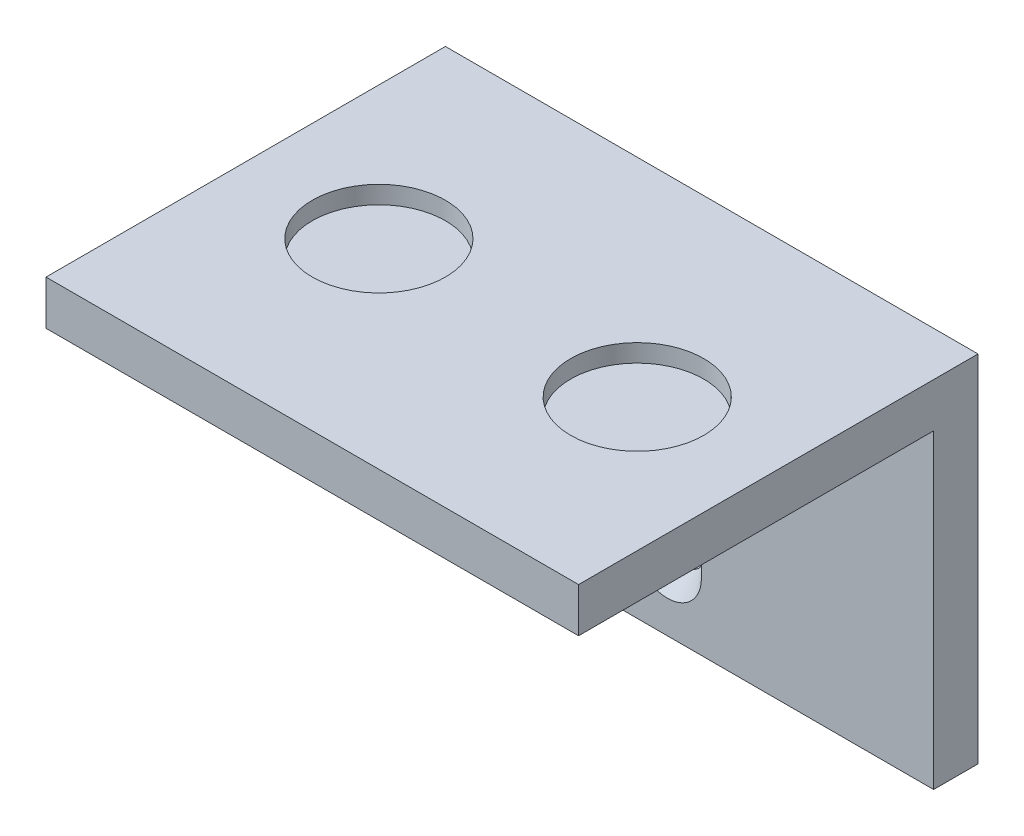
ISO-10303-21;
HEADER;
FILE_DESCRIPTION(('STEP AP214'),'2;1');
FILE_NAME('part.step','',(''),(''),'','','');
FILE_SCHEMA(('AUTOMOTIVE_DESIGN { 1 0 10303 214 1 1 1 1 }'));
ENDSEC;
DATA;
#1=APPLICATION_CONTEXT('core data for automotive mechanical design processes');
#2=APPLICATION_PROTOCOL_DEFINITION('international standard','automotive_design',2000,#1);
#3=PRODUCT_CONTEXT('',#1,'mechanical');
#4=PRODUCT('Part','Part','',(#3));
#5=PRODUCT_RELATED_PRODUCT_CATEGORY('part','',(#4));
#6=PRODUCT_DEFINITION_FORMATION('','',#4);
#7=PRODUCT_DEFINITION_CONTEXT('part definition',#1,'design');
#8=PRODUCT_DEFINITION('design','',#6,#7);
#9=PRODUCT_DEFINITION_SHAPE('','',#8);
#10=(LENGTH_UNIT() NAMED_UNIT(*) SI_UNIT(.MILLI.,.METRE.));
#11=(NAMED_UNIT(*) PLANE_ANGLE_UNIT() SI_UNIT($,.RADIAN.));
#12=(NAMED_UNIT(*) SI_UNIT($,.STERADIAN.) SOLID_ANGLE_UNIT());
#13=UNCERTAINTY_MEASURE_WITH_UNIT(LENGTH_MEASURE(1.E-05),#10,'distance_accuracy_value','');
#14=(GEOMETRIC_REPRESENTATION_CONTEXT(3) GLOBAL_UNCERTAINTY_ASSIGNED_CONTEXT((#13)) GLOBAL_UNIT_ASSIGNED_CONTEXT((#10,
#11,#12)) REPRESENTATION_CONTEXT('',''));
#15=CARTESIAN_POINT('',(0.,0.,0.));
#16=DIRECTION('',(0.,0.,1.));
#17=DIRECTION('',(1.,0.,0.));
#18=AXIS2_PLACEMENT_3D('',#15,#16,#17);
#19=CARTESIAN_POINT('',(0.,0.,12.7));
#20=DIRECTION('',(0.,0.,-1.));
#21=DIRECTION('',(-1.,0.,0.));
#22=AXIS2_PLACEMENT_3D('',#19,#20,#21);
#23=PLANE('',#22);
#24=DIRECTION('',(0.,-1.,0.));
#25=VECTOR('',#24,1.);
#26=CARTESIAN_POINT('',(85.9409,0.,12.7));
#27=LINE('',#26,#25);
#28=CARTESIAN_POINT('',(85.9409,59.89,12.7));
#29=VERTEX_POINT('',#28);
#30=CARTESIAN_POINT('',(85.9409,19.0500015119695,12.7));
#31=VERTEX_POINT('',#30);
#32=EDGE_CURVE('E275',#29,#31,#27,.T.);
#33=ORIENTED_EDGE('',*,*,#32,.T.);
#34=CARTESIAN_POINT('',(76.2,19.05,12.7));
#35=DIRECTION('',(0.,0.,-1.));
#36=DIRECTION('',(-1.,0.,0.));
#37=AXIS2_PLACEMENT_3D('',#34,#35,#36);
#38=CIRCLE('',#37,9.74090000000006);
#39=CARTESIAN_POINT('',(66.4591,19.0500015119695,12.7));
#40=VERTEX_POINT('',#39);
#41=EDGE_CURVE('E278',#31,#40,#38,.T.);
#42=ORIENTED_EDGE('',*,*,#41,.T.);
#43=DIRECTION('',(0.,1.,0.));
#44=VECTOR('',#43,1.);
#45=CARTESIAN_POINT('',(66.4591,59.89,12.7));
#46=LINE('',#45,#44);
#47=CARTESIAN_POINT('',(66.4591,59.89,12.7));
#48=VERTEX_POINT('',#47);
#49=EDGE_CURVE('E269',#40,#48,#46,.T.);
#50=ORIENTED_EDGE('',*,*,#49,.T.);
#51=CARTESIAN_POINT('',(76.2,59.89,12.7));
#52=DIRECTION('',(0.,0.,-1.));
#53=DIRECTION('',(-1.,0.,0.));
#54=AXIS2_PLACEMENT_3D('',#51,#52,#53);
#55=CIRCLE('',#54,9.7409);
#56=EDGE_CURVE('E272',#48,#29,#55,.T.);
#57=ORIENTED_EDGE('',*,*,#56,.T.);
#58=EDGE_LOOP('',(#33,#42,#50,#57));
#59=FACE_BOUND('',#58,.T.);
#60=DIRECTION('',(1.,0.,0.));
#61=VECTOR('',#60,1.);
#62=CARTESIAN_POINT('',(0.,88.9,12.7));
#63=LINE('',#62,#61);
#64=CARTESIAN_POINT('',(0.,88.9,12.7));
#65=VERTEX_POINT('',#64);
#66=CARTESIAN_POINT('',(152.4,88.9,12.7));
#67=VERTEX_POINT('',#66);
#68=EDGE_CURVE('E190',#65,#67,#63,.T.);
#69=ORIENTED_EDGE('',*,*,#68,.F.);
#70=DIRECTION('',(0.,-1.,0.));
#71=VECTOR('',#70,1.);
#72=CARTESIAN_POINT('',(0.,0.,12.7));
#73=LINE('',#72,#71);
#74=CARTESIAN_POINT('',(0.,0.,12.7));
#75=VERTEX_POINT('',#74);
#76=EDGE_CURVE('E229',#65,#75,#73,.T.);
#77=ORIENTED_EDGE('',*,*,#76,.T.);
#78=DIRECTION('',(1.,0.,0.));
#79=VECTOR('',#78,1.);
#80=CARTESIAN_POINT('',(0.,0.,12.7));
#81=LINE('',#80,#79);
#82=CARTESIAN_POINT('',(152.4,0.,12.7));
#83=VERTEX_POINT('',#82);
#84=EDGE_CURVE('E232',#75,#83,#81,.T.);
#85=ORIENTED_EDGE('',*,*,#84,.T.);
#86=DIRECTION('',(0.,1.,0.));
#87=VECTOR('',#86,1.);
#88=CARTESIAN_POINT('',(152.4,0.,12.7));
#89=LINE('',#88,#87);
#90=EDGE_CURVE('E236',#83,#67,#89,.T.);
#91=ORIENTED_EDGE('',*,*,#90,.T.);
#92=EDGE_LOOP('',(#69,#77,#85,#91));
#93=FACE_BOUND('',#92,.T.);
#94=ADVANCED_FACE('F49',(#59,#93),#23,.F.);
#95=CARTESIAN_POINT('',(0.,0.,12.7));
#96=DIRECTION('',(1.,0.,0.));
#97=DIRECTION('',(0.,0.,-1.));
#98=AXIS2_PLACEMENT_3D('',#95,#96,#97);
#99=PLANE('',#98);
#100=DIRECTION('',(0.,-1.,0.));
#101=VECTOR('',#100,1.);
#102=CARTESIAN_POINT('',(0.,0.,0.));
#103=LINE('',#102,#101);
#104=CARTESIAN_POINT('',(0.,101.6,0.));
#105=VERTEX_POINT('',#104);
#106=CARTESIAN_POINT('',(0.,0.,0.));
#107=VERTEX_POINT('',#106);
#108=EDGE_CURVE('E228',#105,#107,#103,.T.);
#109=ORIENTED_EDGE('',*,*,#108,.T.);
#110=DIRECTION('',(0.,0.,-1.));
#111=VECTOR('',#110,1.);
#112=CARTESIAN_POINT('',(0.,0.,12.7));
#113=LINE('',#112,#111);
#114=EDGE_CURVE('E262',#75,#107,#113,.T.);
#115=ORIENTED_EDGE('',*,*,#114,.F.);
#116=ORIENTED_EDGE('',*,*,#76,.F.);
#117=DIRECTION('',(0.,0.,-1.));
#118=VECTOR('',#117,1.);
#119=CARTESIAN_POINT('',(0.,88.9,114.3));
#120=LINE('',#119,#118);
#121=CARTESIAN_POINT('',(0.,88.9,114.3));
#122=VERTEX_POINT('',#121);
#123=EDGE_CURVE('E224',#122,#65,#120,.T.);
#124=ORIENTED_EDGE('',*,*,#123,.F.);
#125=DIRECTION('',(0.,-1.,0.));
#126=VECTOR('',#125,1.);
#127=CARTESIAN_POINT('',(0.,101.6,114.3));
#128=LINE('',#127,#126);
#129=CARTESIAN_POINT('',(0.,101.6,114.3));
#130=VERTEX_POINT('',#129);
#131=EDGE_CURVE('E202',#130,#122,#128,.T.);
#132=ORIENTED_EDGE('',*,*,#131,.F.);
#133=DIRECTION('',(0.,0.,-1.));
#134=VECTOR('',#133,1.);
#135=CARTESIAN_POINT('',(0.,101.6,12.7));
#136=LINE('',#135,#134);
#137=EDGE_CURVE('E239',#130,#105,#136,.T.);
#138=ORIENTED_EDGE('',*,*,#137,.T.);
#139=EDGE_LOOP('',(#109,#115,#116,#124,#132,#138));
#140=FACE_BOUND('',#139,.T.);
#141=ADVANCED_FACE('F318',(#140),#99,.F.);
#142=CARTESIAN_POINT('',(0.,0.,12.7));
#143=DIRECTION('',(0.,1.,0.));
#144=DIRECTION('',(0.,0.,1.));
#145=AXIS2_PLACEMENT_3D('',#142,#143,#144);
#146=PLANE('',#145);
#147=DIRECTION('',(1.,0.,0.));
#148=VECTOR('',#147,1.);
#149=CARTESIAN_POINT('',(0.,0.,0.));
#150=LINE('',#149,#148);
#151=CARTESIAN_POINT('',(152.4,0.,0.));
#152=VERTEX_POINT('',#151);
#153=EDGE_CURVE('E243',#107,#152,#150,.T.);
#154=ORIENTED_EDGE('',*,*,#153,.T.);
#155=DIRECTION('',(0.,0.,-1.));
#156=VECTOR('',#155,1.);
#157=CARTESIAN_POINT('',(152.4,0.,12.7));
#158=LINE('',#157,#156);
#159=EDGE_CURVE('E258',#83,#152,#158,.T.);
#160=ORIENTED_EDGE('',*,*,#159,.F.);
#161=ORIENTED_EDGE('',*,*,#84,.F.);
#162=ORIENTED_EDGE('',*,*,#114,.T.);
#163=EDGE_LOOP('',(#154,#160,#161,#162));
#164=FACE_BOUND('',#163,.T.);
#165=ADVANCED_FACE('F326',(#164),#146,.F.);
#166=CARTESIAN_POINT('',(152.4,0.,12.7));
#167=DIRECTION('',(-1.,0.,0.));
#168=DIRECTION('',(0.,0.,1.));
#169=AXIS2_PLACEMENT_3D('',#166,#167,#168);
#170=PLANE('',#169);
#171=DIRECTION('',(0.,1.,0.));
#172=VECTOR('',#171,1.);
#173=CARTESIAN_POINT('',(152.4,0.,0.));
#174=LINE('',#173,#172);
#175=CARTESIAN_POINT('',(152.4,101.6,0.));
#176=VERTEX_POINT('',#175);
#177=EDGE_CURVE('E246',#152,#176,#174,.T.);
#178=ORIENTED_EDGE('',*,*,#177,.T.);
#179=DIRECTION('',(0.,0.,-1.));
#180=VECTOR('',#179,1.);
#181=CARTESIAN_POINT('',(152.4,101.6,12.7));
#182=LINE('',#181,#180);
#183=CARTESIAN_POINT('',(152.4,101.6,114.3));
#184=VERTEX_POINT('',#183);
#185=EDGE_CURVE('E254',#184,#176,#182,.T.);
#186=ORIENTED_EDGE('',*,*,#185,.F.);
#187=DIRECTION('',(0.,1.,0.));
#188=VECTOR('',#187,1.);
#189=CARTESIAN_POINT('',(152.4,101.6,114.3));
#190=LINE('',#189,#188);
#191=CARTESIAN_POINT('',(152.4,88.9,114.3));
#192=VERTEX_POINT('',#191);
#193=EDGE_CURVE('E209',#192,#184,#190,.T.);
#194=ORIENTED_EDGE('',*,*,#193,.F.);
#195=DIRECTION('',(0.,0.,-1.));
#196=VECTOR('',#195,1.);
#197=CARTESIAN_POINT('',(152.4,88.9,114.3));
#198=LINE('',#197,#196);
#199=EDGE_CURVE('E217',#192,#67,#198,.T.);
#200=ORIENTED_EDGE('',*,*,#199,.T.);
#201=ORIENTED_EDGE('',*,*,#90,.F.);
#202=ORIENTED_EDGE('',*,*,#159,.T.);
#203=EDGE_LOOP('',(#178,#186,#194,#200,#201,#202));
#204=FACE_BOUND('',#203,.T.);
#205=ADVANCED_FACE('F338',(#204),#170,.F.);
#206=CARTESIAN_POINT('',(0.,101.6,12.7));
#207=DIRECTION('',(0.,-1.,0.));
#208=DIRECTION('',(0.,0.,-1.));
#209=AXIS2_PLACEMENT_3D('',#206,#207,#208);
#210=PLANE('',#209);
#211=CARTESIAN_POINT('',(38.1,101.6,57.15));
#212=DIRECTION('',(0.,1.,0.));
#213=DIRECTION('',(0.,0.,1.));
#214=AXIS2_PLACEMENT_3D('',#211,#212,#213);
#215=CIRCLE('',#214,19.05);
#216=CARTESIAN_POINT('',(38.1,101.6,76.2));
#217=VERTEX_POINT('',#216);
#218=EDGE_CURVE('E191',#217,#217,#215,.T.);
#219=ORIENTED_EDGE('',*,*,#218,.F.);
#220=EDGE_LOOP('',(#219));
#221=FACE_BOUND('',#220,.T.);
#222=CARTESIAN_POINT('',(114.3,101.6,59.4174520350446));
#223=DIRECTION('',(0.,1.,0.));
#224=DIRECTION('',(0.,0.,1.));
#225=AXIS2_PLACEMENT_3D('',#222,#223,#224);
#226=CIRCLE('',#225,19.05);
#227=CARTESIAN_POINT('',(114.3,101.6,78.4674520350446));
#228=VERTEX_POINT('',#227);
#229=EDGE_CURVE('E195',#228,#228,#226,.T.);
#230=ORIENTED_EDGE('',*,*,#229,.F.);
#231=EDGE_LOOP('',(#230));
#232=FACE_BOUND('',#231,.T.);
#233=DIRECTION('',(-1.,0.,0.));
#234=VECTOR('',#233,1.);
#235=CARTESIAN_POINT('',(0.,101.6,0.));
#236=LINE('',#235,#234);
#237=EDGE_CURVE('E233',#176,#105,#236,.T.);
#238=ORIENTED_EDGE('',*,*,#237,.T.);
#239=ORIENTED_EDGE('',*,*,#137,.F.);
#240=DIRECTION('',(-1.,0.,0.));
#241=VECTOR('',#240,1.);
#242=CARTESIAN_POINT('',(0.,101.6,114.3));
#243=LINE('',#242,#241);
#244=EDGE_CURVE('E213',#184,#130,#243,.T.);
#245=ORIENTED_EDGE('',*,*,#244,.F.);
#246=ORIENTED_EDGE('',*,*,#185,.T.);
#247=EDGE_LOOP('',(#238,#239,#245,#246));
#248=FACE_BOUND('',#247,.T.);
#249=ADVANCED_FACE('F335',(#221,#232,#248),#210,.F.);
#250=CARTESIAN_POINT('',(0.,0.,0.));
#251=DIRECTION('',(0.,0.,-1.));
#252=DIRECTION('',(-1.,0.,0.));
#253=AXIS2_PLACEMENT_3D('',#250,#251,#252);
#254=PLANE('',#253);
#255=CARTESIAN_POINT('',(76.2,59.89,0.));
#256=DIRECTION('',(0.,0.,1.));
#257=DIRECTION('',(1.,0.,0.));
#258=AXIS2_PLACEMENT_3D('',#255,#256,#257);
#259=CIRCLE('',#258,4.826);
#260=CARTESIAN_POINT('',(81.026,59.89,0.));
#261=VERTEX_POINT('',#260);
#262=CARTESIAN_POINT('',(71.374,59.89,0.));
#263=VERTEX_POINT('',#262);
#264=EDGE_CURVE('E167',#261,#263,#259,.T.);
#265=ORIENTED_EDGE('',*,*,#264,.T.);
#266=DIRECTION('',(0.,-1.,0.));
#267=VECTOR('',#266,1.);
#268=CARTESIAN_POINT('',(71.374,59.89,0.));
#269=LINE('',#268,#267);
#270=CARTESIAN_POINT('',(71.374,19.0500007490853,0.));
#271=VERTEX_POINT('',#270);
#272=EDGE_CURVE('E145',#263,#271,#269,.T.);
#273=ORIENTED_EDGE('',*,*,#272,.T.);
#274=CARTESIAN_POINT('',(76.2,19.05,0.));
#275=DIRECTION('',(0.,0.,1.));
#276=DIRECTION('',(1.,0.,0.));
#277=AXIS2_PLACEMENT_3D('',#274,#275,#276);
#278=CIRCLE('',#277,4.82600000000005);
#279=CARTESIAN_POINT('',(81.026,19.0500007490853,0.));
#280=VERTEX_POINT('',#279);
#281=EDGE_CURVE('E156',#271,#280,#278,.T.);
#282=ORIENTED_EDGE('',*,*,#281,.T.);
#283=DIRECTION('',(0.,-1.,0.));
#284=VECTOR('',#283,1.);
#285=CARTESIAN_POINT('',(81.026,59.89,0.));
#286=LINE('',#285,#284);
#287=EDGE_CURVE('E162',#261,#280,#286,.T.);
#288=ORIENTED_EDGE('',*,*,#287,.F.);
#289=EDGE_LOOP('',(#265,#273,#282,#288));
#290=FACE_BOUND('',#289,.T.);
#291=ORIENTED_EDGE('',*,*,#108,.F.);
#292=ORIENTED_EDGE('',*,*,#237,.F.);
#293=ORIENTED_EDGE('',*,*,#177,.F.);
#294=ORIENTED_EDGE('',*,*,#153,.F.);
#295=EDGE_LOOP('',(#291,#292,#293,#294));
#296=FACE_BOUND('',#295,.T.);
#297=ADVANCED_FACE('F164',(#290,#296),#254,.T.);
#298=CARTESIAN_POINT('',(0.,88.9,114.3));
#299=DIRECTION('',(0.,1.,0.));
#300=DIRECTION('',(0.,0.,1.));
#301=AXIS2_PLACEMENT_3D('',#298,#299,#300);
#302=PLANE('',#301);
#303=ORIENTED_EDGE('',*,*,#68,.T.);
#304=ORIENTED_EDGE('',*,*,#199,.F.);
#305=DIRECTION('',(1.,0.,0.));
#306=VECTOR('',#305,1.);
#307=CARTESIAN_POINT('',(0.,88.9,114.3));
#308=LINE('',#307,#306);
#309=EDGE_CURVE('E206',#122,#192,#308,.T.);
#310=ORIENTED_EDGE('',*,*,#309,.F.);
#311=ORIENTED_EDGE('',*,*,#123,.T.);
#312=EDGE_LOOP('',(#303,#304,#310,#311));
#313=FACE_BOUND('',#312,.T.);
#314=ADVANCED_FACE('F332',(#313),#302,.F.);
#315=CARTESIAN_POINT('',(0.,0.,114.3));
#316=DIRECTION('',(0.,0.,1.));
#317=DIRECTION('',(1.,0.,0.));
#318=AXIS2_PLACEMENT_3D('',#315,#316,#317);
#319=PLANE('',#318);
#320=ORIENTED_EDGE('',*,*,#131,.T.);
#321=ORIENTED_EDGE('',*,*,#309,.T.);
#322=ORIENTED_EDGE('',*,*,#193,.T.);
#323=ORIENTED_EDGE('',*,*,#244,.T.);
#324=EDGE_LOOP('',(#320,#321,#322,#323));
#325=FACE_BOUND('',#324,.T.);
#326=ADVANCED_FACE('F438',(#325),#319,.T.);
#327=CARTESIAN_POINT('',(114.3,96.52,59.4174520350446));
#328=DIRECTION('',(0.,1.,0.));
#329=DIRECTION('',(0.,0.,1.));
#330=AXIS2_PLACEMENT_3D('',#327,#328,#329);
#331=CYLINDRICAL_SURFACE('',#330,19.05);
#332=CARTESIAN_POINT('',(114.3,96.52,59.4174520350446));
#333=DIRECTION('',(0.,1.,0.));
#334=DIRECTION('',(0.,0.,1.));
#335=AXIS2_PLACEMENT_3D('',#332,#333,#334);
#336=CIRCLE('',#335,19.05);
#337=CARTESIAN_POINT('',(114.3,96.52,78.4674520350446));
#338=VERTEX_POINT('',#337);
#339=EDGE_CURVE('E152',#338,#338,#336,.T.);
#340=ORIENTED_EDGE('',*,*,#339,.F.);
#341=EDGE_LOOP('',(#340));
#342=FACE_BOUND('',#341,.T.);
#343=ORIENTED_EDGE('',*,*,#229,.T.);
#344=EDGE_LOOP('',(#343));
#345=FACE_BOUND('',#344,.T.);
#346=ADVANCED_FACE('F429',(#342,#345),#331,.F.);
#347=CARTESIAN_POINT('',(114.3,96.52,59.4174520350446));
#348=DIRECTION('',(0.,1.,0.));
#349=DIRECTION('',(0.,0.,1.));
#350=AXIS2_PLACEMENT_3D('',#347,#348,#349);
#351=PLANE('',#350);
#352=ORIENTED_EDGE('',*,*,#339,.T.);
#353=EDGE_LOOP('',(#352));
#354=FACE_BOUND('',#353,.T.);
#355=ADVANCED_FACE('F420',(#354),#351,.T.);
#356=CARTESIAN_POINT('',(38.1,96.52,57.15));
#357=DIRECTION('',(0.,1.,0.));
#358=DIRECTION('',(0.,0.,1.));
#359=AXIS2_PLACEMENT_3D('',#356,#357,#358);
#360=CYLINDRICAL_SURFACE('',#359,19.05);
#361=CARTESIAN_POINT('',(38.1,96.52,57.15));
#362=DIRECTION('',(0.,1.,0.));
#363=DIRECTION('',(0.,0.,1.));
#364=AXIS2_PLACEMENT_3D('',#361,#362,#363);
#365=CIRCLE('',#364,19.05);
#366=CARTESIAN_POINT('',(38.1,96.52,76.2));
#367=VERTEX_POINT('',#366);
#368=EDGE_CURVE('E186',#367,#367,#365,.T.);
#369=ORIENTED_EDGE('',*,*,#368,.F.);
#370=EDGE_LOOP('',(#369));
#371=FACE_BOUND('',#370,.T.);
#372=ORIENTED_EDGE('',*,*,#218,.T.);
#373=EDGE_LOOP('',(#372));
#374=FACE_BOUND('',#373,.T.);
#375=ADVANCED_FACE('F411',(#371,#374),#360,.F.);
#376=CARTESIAN_POINT('',(38.1,96.52,57.15));
#377=DIRECTION('',(0.,1.,0.));
#378=DIRECTION('',(0.,0.,1.));
#379=AXIS2_PLACEMENT_3D('',#376,#377,#378);
#380=PLANE('',#379);
#381=ORIENTED_EDGE('',*,*,#368,.T.);
#382=EDGE_LOOP('',(#381));
#383=FACE_BOUND('',#382,.T.);
#384=ADVANCED_FACE('F403',(#383),#380,.T.);
#385=CARTESIAN_POINT('',(71.374,59.89,114.3));
#386=DIRECTION('',(1.,0.,0.));
#387=DIRECTION('',(0.,0.,-1.));
#388=AXIS2_PLACEMENT_3D('',#385,#386,#387);
#389=PLANE('',#388);
#390=DIRECTION('',(0.,0.,-1.));
#391=VECTOR('',#390,1.);
#392=CARTESIAN_POINT('',(71.374,59.89,114.3));
#393=LINE('',#392,#391);
#394=CARTESIAN_POINT('',(71.374,59.89,7.04605431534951));
#395=VERTEX_POINT('',#394);
#396=EDGE_CURVE('E178',#395,#263,#393,.T.);
#397=ORIENTED_EDGE('',*,*,#396,.F.);
#398=DIRECTION('',(0.,-1.,0.));
#399=VECTOR('',#398,1.);
#400=CARTESIAN_POINT('',(71.374,19.0500007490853,7.04605431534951));
#401=LINE('',#400,#399);
#402=CARTESIAN_POINT('',(71.374,19.0500007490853,7.04605431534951));
#403=VERTEX_POINT('',#402);
#404=EDGE_CURVE('E11',#395,#403,#401,.T.);
#405=ORIENTED_EDGE('',*,*,#404,.T.);
#406=DIRECTION('',(0.,0.,-1.));
#407=VECTOR('',#406,1.);
#408=CARTESIAN_POINT('',(71.374,19.0500007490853,114.3));
#409=LINE('',#408,#407);
#410=EDGE_CURVE('E141',#403,#271,#409,.T.);
#411=ORIENTED_EDGE('',*,*,#410,.T.);
#412=ORIENTED_EDGE('',*,*,#272,.F.);
#413=EDGE_LOOP('',(#397,#405,#411,#412));
#414=FACE_BOUND('',#413,.T.);
#415=ADVANCED_FACE('F143',(#414),#389,.T.);
#416=CARTESIAN_POINT('',(76.2,19.05,114.3));
#417=DIRECTION('',(0.,0.,-1.));
#418=DIRECTION('',(-1.,0.,0.));
#419=AXIS2_PLACEMENT_3D('',#416,#417,#418);
#420=CYLINDRICAL_SURFACE('',#419,4.82600000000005);
#421=ORIENTED_EDGE('',*,*,#410,.F.);
#422=CARTESIAN_POINT('',(76.2,19.05,7.04605431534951));
#423=DIRECTION('',(0.,0.,-1.));
#424=DIRECTION('',(-1.,0.,0.));
#425=AXIS2_PLACEMENT_3D('',#422,#423,#424);
#426=CIRCLE('',#425,4.82600000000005);
#427=CARTESIAN_POINT('',(81.026,19.0500007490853,7.04605431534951));
#428=VERTEX_POINT('',#427);
#429=EDGE_CURVE('E266',#403,#428,#426,.F.);
#430=ORIENTED_EDGE('',*,*,#429,.T.);
#431=DIRECTION('',(0.,0.,-1.));
#432=VECTOR('',#431,1.);
#433=CARTESIAN_POINT('',(81.026,19.0500007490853,114.3));
#434=LINE('',#433,#432);
#435=EDGE_CURVE('E153',#428,#280,#434,.T.);
#436=ORIENTED_EDGE('',*,*,#435,.T.);
#437=ORIENTED_EDGE('',*,*,#281,.F.);
#438=EDGE_LOOP('',(#421,#430,#436,#437));
#439=FACE_BOUND('',#438,.T.);
#440=ADVANCED_FACE('F157',(#439),#420,.F.);
#441=CARTESIAN_POINT('',(81.026,59.89,114.3));
#442=DIRECTION('',(1.,0.,0.));
#443=DIRECTION('',(0.,0.,-1.));
#444=AXIS2_PLACEMENT_3D('',#441,#442,#443);
#445=PLANE('',#444);
#446=ORIENTED_EDGE('',*,*,#435,.F.);
#447=DIRECTION('',(0.,1.,0.));
#448=VECTOR('',#447,1.);
#449=CARTESIAN_POINT('',(81.026,59.89,7.04605431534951));
#450=LINE('',#449,#448);
#451=CARTESIAN_POINT('',(81.026,59.89,7.04605431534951));
#452=VERTEX_POINT('',#451);
#453=EDGE_CURVE('E75',#428,#452,#450,.T.);
#454=ORIENTED_EDGE('',*,*,#453,.T.);
#455=DIRECTION('',(0.,0.,-1.));
#456=VECTOR('',#455,1.);
#457=CARTESIAN_POINT('',(81.026,59.89,114.3));
#458=LINE('',#457,#456);
#459=EDGE_CURVE('E181',#452,#261,#458,.T.);
#460=ORIENTED_EDGE('',*,*,#459,.T.);
#461=ORIENTED_EDGE('',*,*,#287,.T.);
#462=EDGE_LOOP('',(#446,#454,#460,#461));
#463=FACE_BOUND('',#462,.T.);
#464=ADVANCED_FACE('F308',(#463),#445,.F.);
#465=CARTESIAN_POINT('',(76.2,59.89,114.3));
#466=DIRECTION('',(0.,0.,-1.));
#467=DIRECTION('',(-1.,0.,0.));
#468=AXIS2_PLACEMENT_3D('',#465,#466,#467);
#469=CYLINDRICAL_SURFACE('',#468,4.826);
#470=ORIENTED_EDGE('',*,*,#459,.F.);
#471=CARTESIAN_POINT('',(76.2,59.89,7.04605431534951));
#472=DIRECTION('',(0.,0.,-1.));
#473=DIRECTION('',(-1.,0.,0.));
#474=AXIS2_PLACEMENT_3D('',#471,#472,#473);
#475=CIRCLE('',#474,4.826);
#476=EDGE_CURVE('E60',#452,#395,#475,.F.);
#477=ORIENTED_EDGE('',*,*,#476,.T.);
#478=ORIENTED_EDGE('',*,*,#396,.T.);
#479=ORIENTED_EDGE('',*,*,#264,.F.);
#480=EDGE_LOOP('',(#470,#477,#478,#479));
#481=FACE_BOUND('',#480,.T.);
#482=ADVANCED_FACE('F309',(#481),#469,.F.);
#483=CARTESIAN_POINT('',(76.2,59.89,7.04605431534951));
#484=DIRECTION('',(0.,0.,1.));
#485=DIRECTION('',(1.,0.,0.));
#486=AXIS2_PLACEMENT_3D('',#483,#484,#485);
#487=CONICAL_SURFACE('',#486,4.826,0.715584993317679);
#488=DIRECTION('',(-0.65605902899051,0.,-0.754709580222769));
#489=VECTOR('',#488,1.);
#490=CARTESIAN_POINT('',(85.9409,59.89,12.7));
#491=LINE('',#490,#489);
#492=EDGE_CURVE('E172',#29,#452,#491,.T.);
#493=ORIENTED_EDGE('',*,*,#492,.F.);
#494=ORIENTED_EDGE('',*,*,#56,.F.);
#495=DIRECTION('',(-0.65605902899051,0.,0.754709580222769));
#496=VECTOR('',#495,1.);
#497=CARTESIAN_POINT('',(71.374,59.89,7.04605431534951));
#498=LINE('',#497,#496);
#499=EDGE_CURVE('E54',#395,#48,#498,.T.);
#500=ORIENTED_EDGE('',*,*,#499,.F.);
#501=ORIENTED_EDGE('',*,*,#476,.F.);
#502=EDGE_LOOP('',(#493,#494,#500,#501));
#503=FACE_BOUND('',#502,.T.);
#504=ADVANCED_FACE('F52',(#503),#487,.F.);
#505=CARTESIAN_POINT('',(71.374,59.89,7.04605431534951));
#506=DIRECTION('',(0.754709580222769,0.,0.65605902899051));
#507=DIRECTION('',(0.,1.,0.));
#508=AXIS2_PLACEMENT_3D('',#505,#506,#507);
#509=PLANE('',#508);
#510=ORIENTED_EDGE('',*,*,#499,.T.);
#511=ORIENTED_EDGE('',*,*,#49,.F.);
#512=DIRECTION('',(-0.656059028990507,1.0183260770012E-07,0.754709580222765));
#513=VECTOR('',#512,1.);
#514=CARTESIAN_POINT('',(71.374,19.0500007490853,7.04605431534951));
#515=LINE('',#514,#513);
#516=EDGE_CURVE('E289',#403,#40,#515,.T.);
#517=ORIENTED_EDGE('',*,*,#516,.F.);
#518=ORIENTED_EDGE('',*,*,#404,.F.);
#519=EDGE_LOOP('',(#510,#511,#517,#518));
#520=FACE_BOUND('',#519,.T.);
#521=ADVANCED_FACE('F303',(#520),#509,.T.);
#522=CARTESIAN_POINT('',(85.9409,0.,12.7));
#523=DIRECTION('',(0.754709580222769,0.,-0.65605902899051));
#524=DIRECTION('',(0.,-1.,0.));
#525=AXIS2_PLACEMENT_3D('',#522,#523,#524);
#526=PLANE('',#525);
#527=ORIENTED_EDGE('',*,*,#492,.T.);
#528=ORIENTED_EDGE('',*,*,#453,.F.);
#529=DIRECTION('',(-0.656059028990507,-1.01832608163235E-07,-0.754709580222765));
#530=VECTOR('',#529,1.);
#531=CARTESIAN_POINT('',(85.9409,19.0500015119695,12.7));
#532=LINE('',#531,#530);
#533=EDGE_CURVE('E286',#31,#428,#532,.T.);
#534=ORIENTED_EDGE('',*,*,#533,.F.);
#535=ORIENTED_EDGE('',*,*,#32,.F.);
#536=EDGE_LOOP('',(#527,#528,#534,#535));
#537=FACE_BOUND('',#536,.T.);
#538=ADVANCED_FACE('F296',(#537),#526,.F.);
#539=CARTESIAN_POINT('',(76.2,19.05,7.04605431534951));
#540=DIRECTION('',(0.,0.,1.));
#541=DIRECTION('',(1.,0.,0.));
#542=AXIS2_PLACEMENT_3D('',#539,#540,#541);
#543=CONICAL_SURFACE('',#542,4.82600000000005,0.715584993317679);
#544=ORIENTED_EDGE('',*,*,#516,.T.);
#545=ORIENTED_EDGE('',*,*,#41,.F.);
#546=ORIENTED_EDGE('',*,*,#533,.T.);
#547=ORIENTED_EDGE('',*,*,#429,.F.);
#548=EDGE_LOOP('',(#544,#545,#546,#547));
#549=FACE_BOUND('',#548,.T.);
#550=ADVANCED_FACE('F307',(#549),#543,.F.);
#551=CLOSED_SHELL('',(#94,#141,#165,#205,#249,#297,#314,#326,#346,#355,#375,#384,#415,#440,#464,
#482,#504,#521,#538,#550));
#552=MANIFOLD_SOLID_BREP('B2',#551);
#553=ADVANCED_BREP_SHAPE_REPRESENTATION('',(#18,#552),#14);
#554=SHAPE_DEFINITION_REPRESENTATION(#9,#553);
ENDSEC;
END-ISO-10303-21;
